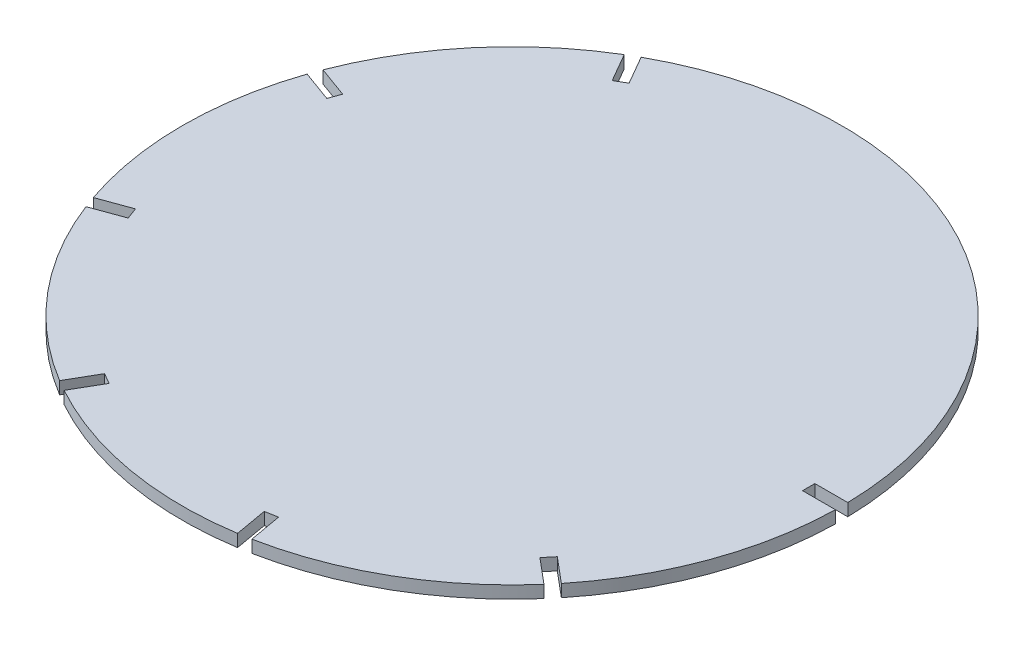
from build123d import *

# Parameters (mm, degrees)
SKETCH1_R           = 400
BOSS_EXTRUDE1_DEPTH = 15
CUT_EXTRUDE3_START  = -15
CUT_EXTRUDE3_DEPTH  = 15


with BuildPart() as part:
    # Sketch1 → Boss-Extrude1 (new body)
    with BuildSketch(Plane(origin=(0, 0, 0), x_dir=(1, 0, 0), z_dir=(0, 1, 0))):
        with Locations(Location((0, 0, 0), (0, 0, 270))):
            Circle(SKETCH1_R)
    extrude(amount=BOSS_EXTRUDE1_DEPTH)

    # Sketch2 → Cut-Extrude3 (cut)
    with BuildSketch(Plane(origin=(0, 15, 0), x_dir=(1, 0, 0), z_dir=(0, 1, 0)).offset(CUT_EXTRUDE3_START)):
        with BuildLine():
            Line((399.929681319, 7.5), (360, 7.5))
            Line((360, 7.5), (360, -7.5))
            Line((360, -7.5), (399.929681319, -7.5))
            ThreePointArc((399.929681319, -7.5), (400, 0), (399.929681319, 7.5))
        make_face()
        with BuildLine():
            Line((-173.504809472, 315.519145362), (-193.469650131, 350.09926375))
            ThreePointArc((-193.469650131, 350.09926375), (-200, 346.410161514), (-206.460031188, 342.59926375))
            Line((-206.460031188, 342.59926375), (-186.495190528, 308.019145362))
            Line((-186.495190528, 308.019145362), (-173.504809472, 315.519145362))
        make_face()
        with BuildLine():
            ThreePointArc((301.54300294, -262.815177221), (306.417777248, -257.115043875), (311.184817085, -251.324510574))
            Line((311.184817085, -251.324510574), (280.596906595, -225.658206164))
            Line((280.596906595, -225.658206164), (270.95509245, -237.148872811))
            Line((270.95509245, -237.148872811), (301.54300294, -262.815177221))
        make_face()
        with BuildLine():
            Line((-335.724192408, 130.174946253), (-373.245819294, 143.831701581))
            ThreePointArc((-373.245819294, 143.831701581), (-375.877048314, 136.80805733), (-378.376121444, 129.736312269))
            Line((-378.376121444, 129.736312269), (-340.854494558, 116.079556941))
            Line((-340.854494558, 116.079556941), (-335.724192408, 130.174946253))
        make_face()
        with BuildLine():
            ThreePointArc((62.061002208, -395.156212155), (69.459271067, -393.923101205), (76.833118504, -392.55148949))
            Line((76.833118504, -392.55148949), (69.899402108, -353.228429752))
            Line((69.899402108, -353.228429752), (55.127285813, -355.833152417))
            Line((55.127285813, -355.833152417), (62.061002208, -395.156212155))
        make_face()
        with BuildLine():
            Line((-340.854494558, -116.079556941), (-378.376121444, -129.736312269))
            ThreePointArc((-378.376121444, -129.736312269), (-375.877048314, -136.80805733), (-373.245819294, -143.831701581))
            Line((-373.245819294, -143.831701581), (-335.724192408, -130.174946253))
            Line((-335.724192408, -130.174946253), (-340.854494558, -116.079556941))
        make_face()
        with BuildLine():
            ThreePointArc((-206.460031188, -342.59926375), (-200, -346.410161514), (-193.469650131, -350.09926375))
            Line((-193.469650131, -350.09926375), (-173.504809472, -315.519145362))
            Line((-173.504809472, -315.519145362), (-186.495190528, -308.019145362))
            Line((-186.495190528, -308.019145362), (-206.460031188, -342.59926375))
        make_face()
    extrude(amount=CUT_EXTRUDE3_DEPTH, mode=Mode.SUBTRACT)


solid = part.part
